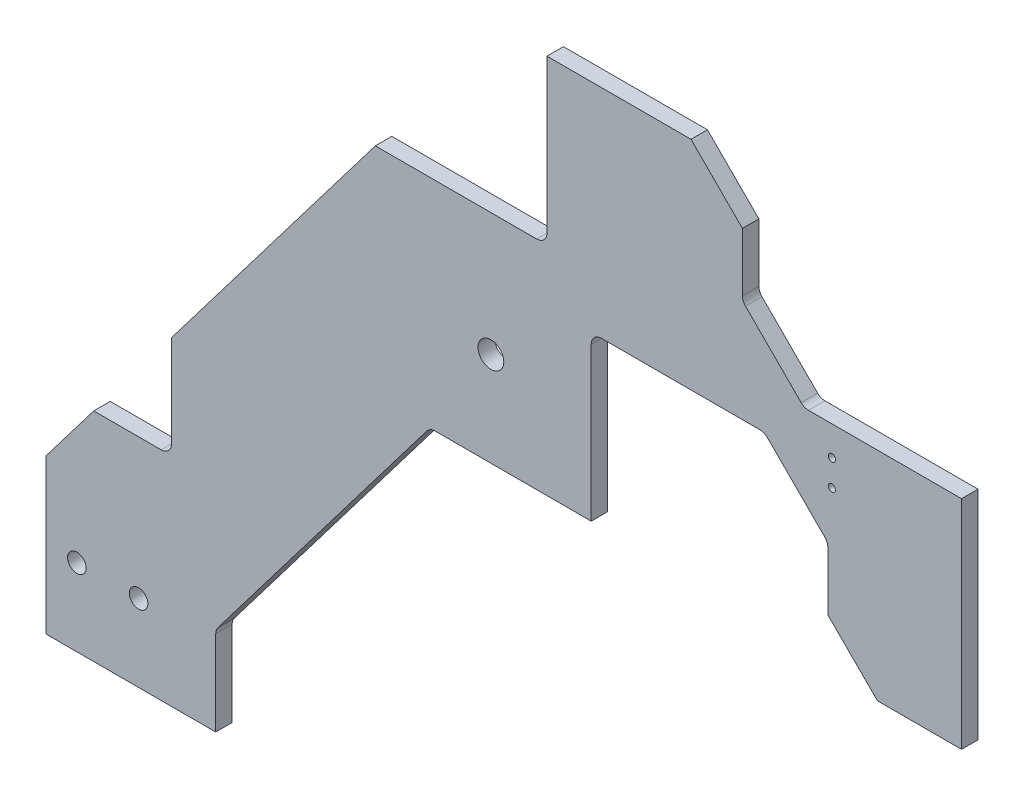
ISO-10303-21;
HEADER;
FILE_DESCRIPTION(('STEP AP214'),'2;1');
FILE_NAME('part.step','',(''),(''),'','','');
FILE_SCHEMA(('AUTOMOTIVE_DESIGN { 1 0 10303 214 1 1 1 1 }'));
ENDSEC;
DATA;
#1=APPLICATION_CONTEXT('core data for automotive mechanical design processes');
#2=APPLICATION_PROTOCOL_DEFINITION('international standard','automotive_design',2000,#1);
#3=PRODUCT_CONTEXT('',#1,'mechanical');
#4=PRODUCT('Part','Part','',(#3));
#5=PRODUCT_RELATED_PRODUCT_CATEGORY('part','',(#4));
#6=PRODUCT_DEFINITION_FORMATION('','',#4);
#7=PRODUCT_DEFINITION_CONTEXT('part definition',#1,'design');
#8=PRODUCT_DEFINITION('design','',#6,#7);
#9=PRODUCT_DEFINITION_SHAPE('','',#8);
#10=(LENGTH_UNIT() NAMED_UNIT(*) SI_UNIT(.MILLI.,.METRE.));
#11=(NAMED_UNIT(*) PLANE_ANGLE_UNIT() SI_UNIT($,.RADIAN.));
#12=(NAMED_UNIT(*) SI_UNIT($,.STERADIAN.) SOLID_ANGLE_UNIT());
#13=UNCERTAINTY_MEASURE_WITH_UNIT(LENGTH_MEASURE(1.E-05),#10,'distance_accuracy_value','');
#14=(GEOMETRIC_REPRESENTATION_CONTEXT(3) GLOBAL_UNCERTAINTY_ASSIGNED_CONTEXT((#13)) GLOBAL_UNIT_ASSIGNED_CONTEXT((#10,
#11,#12)) REPRESENTATION_CONTEXT('',''));
#15=CARTESIAN_POINT('',(0.,0.,0.));
#16=DIRECTION('',(0.,0.,1.));
#17=DIRECTION('',(1.,0.,0.));
#18=AXIS2_PLACEMENT_3D('',#15,#16,#17);
#19=CARTESIAN_POINT('',(68.7,59.308756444,0.));
#20=DIRECTION('',(0.,0.,-1.));
#21=DIRECTION('',(-1.,0.,0.));
#22=AXIS2_PLACEMENT_3D('',#19,#20,#21);
#23=CYLINDRICAL_SURFACE('',#22,1.);
#24=CARTESIAN_POINT('',(68.7,59.308756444,0.));
#25=DIRECTION('',(0.,0.,-1.));
#26=DIRECTION('',(-1.,0.,0.));
#27=AXIS2_PLACEMENT_3D('',#24,#25,#26);
#28=CIRCLE('',#27,1.);
#29=CARTESIAN_POINT('',(67.6999999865,59.308756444,0.));
#30=VERTEX_POINT('',#29);
#31=CARTESIAN_POINT('',(67.992893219,58.601649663,0.));
#32=VERTEX_POINT('',#31);
#33=EDGE_CURVE('E233',#30,#32,#28,.F.);
#34=ORIENTED_EDGE('',*,*,#33,.T.);
#35=DIRECTION('',(0.,0.,1.));
#36=VECTOR('',#35,1.);
#37=CARTESIAN_POINT('',(67.992893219,58.601649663,-0.8));
#38=LINE('',#37,#36);
#39=CARTESIAN_POINT('',(67.9928932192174,58.6016496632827,-1.6));
#40=VERTEX_POINT('',#39);
#41=EDGE_CURVE('E231',#40,#32,#38,.T.);
#42=ORIENTED_EDGE('',*,*,#41,.F.);
#43=CARTESIAN_POINT('',(68.7,59.308756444,-1.6));
#44=DIRECTION('',(0.,0.,-1.));
#45=DIRECTION('',(-1.,0.,0.));
#46=AXIS2_PLACEMENT_3D('',#43,#44,#45);
#47=CIRCLE('',#46,1.);
#48=CARTESIAN_POINT('',(67.6999999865,59.308756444,-1.6));
#49=VERTEX_POINT('',#48);
#50=EDGE_CURVE('E20',#40,#49,#47,.T.);
#51=ORIENTED_EDGE('',*,*,#50,.T.);
#52=DIRECTION('',(0.,0.,-1.));
#53=VECTOR('',#52,1.);
#54=CARTESIAN_POINT('',(67.7,59.308756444,-0.8));
#55=LINE('',#54,#53);
#56=EDGE_CURVE('E228',#30,#49,#55,.T.);
#57=ORIENTED_EDGE('',*,*,#56,.F.);
#58=EDGE_LOOP('',(#34,#42,#51,#57));
#59=FACE_BOUND('',#58,.T.);
#60=ADVANCED_FACE('F16',(#59),#23,.F.);
#61=CARTESIAN_POINT('',(74.114213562,53.894542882,0.));
#62=DIRECTION('',(0.,0.,-1.));
#63=DIRECTION('',(-1.,0.,0.));
#64=AXIS2_PLACEMENT_3D('',#61,#62,#63);
#65=CYLINDRICAL_SURFACE('',#64,1.);
#66=CARTESIAN_POINT('',(74.114213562,53.894542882,0.));
#67=DIRECTION('',(0.,0.,-1.));
#68=DIRECTION('',(-1.,0.,0.));
#69=AXIS2_PLACEMENT_3D('',#66,#67,#68);
#70=CIRCLE('',#69,1.);
#71=CARTESIAN_POINT('',(73.407106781,53.187436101,0.));
#72=VERTEX_POINT('',#71);
#73=CARTESIAN_POINT('',(74.114213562,52.894542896,0.));
#74=VERTEX_POINT('',#73);
#75=EDGE_CURVE('E489',#72,#74,#70,.F.);
#76=ORIENTED_EDGE('',*,*,#75,.T.);
#77=DIRECTION('',(0.,0.,1.));
#78=VECTOR('',#77,1.);
#79=CARTESIAN_POINT('',(74.114213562,52.894542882,-0.8));
#80=LINE('',#79,#78);
#81=CARTESIAN_POINT('',(74.114213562,52.894542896,-1.6));
#82=VERTEX_POINT('',#81);
#83=EDGE_CURVE('E357',#82,#74,#80,.T.);
#84=ORIENTED_EDGE('',*,*,#83,.F.);
#85=CARTESIAN_POINT('',(74.114213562,53.894542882,-1.6));
#86=DIRECTION('',(0.,0.,-1.));
#87=DIRECTION('',(-1.,0.,0.));
#88=AXIS2_PLACEMENT_3D('',#85,#86,#87);
#89=CIRCLE('',#88,1.);
#90=CARTESIAN_POINT('',(73.4071067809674,53.1874361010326,-1.6));
#91=VERTEX_POINT('',#90);
#92=EDGE_CURVE('E491',#82,#91,#89,.T.);
#93=ORIENTED_EDGE('',*,*,#92,.T.);
#94=DIRECTION('',(0.,0.,-1.));
#95=VECTOR('',#94,1.);
#96=CARTESIAN_POINT('',(73.407106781,53.187436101,-0.8));
#97=LINE('',#96,#95);
#98=EDGE_CURVE('E363',#72,#91,#97,.T.);
#99=ORIENTED_EDGE('',*,*,#98,.F.);
#100=EDGE_LOOP('',(#76,#84,#93,#99));
#101=FACE_BOUND('',#100,.T.);
#102=ADVANCED_FACE('F504',(#101),#65,.F.);
#103=CARTESIAN_POINT('',(75.,42.308756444,0.));
#104=DIRECTION('',(0.,0.,-1.));
#105=DIRECTION('',(-1.,0.,0.));
#106=AXIS2_PLACEMENT_3D('',#103,#104,#105);
#107=CYLINDRICAL_SURFACE('',#106,1.);
#108=CARTESIAN_POINT('',(75.,42.308756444,0.));
#109=DIRECTION('',(0.,0.,-1.));
#110=DIRECTION('',(-1.,0.,0.));
#111=AXIS2_PLACEMENT_3D('',#108,#109,#110);
#112=CIRCLE('',#111,1.);
#113=CARTESIAN_POINT('',(75.999999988,42.308756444,0.));
#114=VERTEX_POINT('',#113);
#115=CARTESIAN_POINT('',(75.7071067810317,43.0158632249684,0.));
#116=VERTEX_POINT('',#115);
#117=EDGE_CURVE('E485',#114,#116,#112,.F.);
#118=ORIENTED_EDGE('',*,*,#117,.T.);
#119=DIRECTION('',(0.,0.,1.));
#120=VECTOR('',#119,1.);
#121=CARTESIAN_POINT('',(75.707106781,43.015863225,-0.8));
#122=LINE('',#121,#120);
#123=CARTESIAN_POINT('',(75.7071067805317,43.0158632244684,-1.6));
#124=VERTEX_POINT('',#123);
#125=EDGE_CURVE('E327',#124,#116,#122,.T.);
#126=ORIENTED_EDGE('',*,*,#125,.F.);
#127=CARTESIAN_POINT('',(75.,42.308756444,-1.6));
#128=DIRECTION('',(0.,0.,-1.));
#129=DIRECTION('',(-1.,0.,0.));
#130=AXIS2_PLACEMENT_3D('',#127,#128,#129);
#131=CIRCLE('',#130,1.);
#132=CARTESIAN_POINT('',(75.999999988,42.308756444,-1.6));
#133=VERTEX_POINT('',#132);
#134=EDGE_CURVE('E487',#124,#133,#131,.T.);
#135=ORIENTED_EDGE('',*,*,#134,.T.);
#136=DIRECTION('',(0.,0.,-1.));
#137=VECTOR('',#136,1.);
#138=CARTESIAN_POINT('',(76.,42.308756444,-0.8));
#139=LINE('',#138,#137);
#140=EDGE_CURVE('E333',#114,#133,#139,.T.);
#141=ORIENTED_EDGE('',*,*,#140,.F.);
#142=EDGE_LOOP('',(#118,#126,#135,#141));
#143=FACE_BOUND('',#142,.T.);
#144=ADVANCED_FACE('F655',(#143),#107,.F.);
#145=CARTESIAN_POINT('',(69.414213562,47.894542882,0.));
#146=DIRECTION('',(0.,0.,-1.));
#147=DIRECTION('',(-1.,0.,0.));
#148=AXIS2_PLACEMENT_3D('',#145,#146,#147);
#149=CYLINDRICAL_SURFACE('',#148,1.);
#150=CARTESIAN_POINT('',(69.414213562,47.894542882,0.));
#151=DIRECTION('',(0.,0.,-1.));
#152=DIRECTION('',(-1.,0.,0.));
#153=AXIS2_PLACEMENT_3D('',#150,#151,#152);
#154=CIRCLE('',#153,1.);
#155=CARTESIAN_POINT('',(70.1213203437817,48.6016496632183,0.));
#156=VERTEX_POINT('',#155);
#157=CARTESIAN_POINT('',(69.414213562,48.8945428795,0.));
#158=VERTEX_POINT('',#157);
#159=EDGE_CURVE('E481',#156,#158,#154,.F.);
#160=ORIENTED_EDGE('',*,*,#159,.T.);
#161=DIRECTION('',(0.,0.,1.));
#162=VECTOR('',#161,1.);
#163=CARTESIAN_POINT('',(69.414213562,48.894542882,-0.8));
#164=LINE('',#163,#162);
#165=CARTESIAN_POINT('',(69.414213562,48.8945428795,-1.6));
#166=VERTEX_POINT('',#165);
#167=EDGE_CURVE('E323',#166,#158,#164,.T.);
#168=ORIENTED_EDGE('',*,*,#167,.F.);
#169=CARTESIAN_POINT('',(69.414213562,47.894542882,-1.6));
#170=DIRECTION('',(0.,0.,-1.));
#171=DIRECTION('',(-1.,0.,0.));
#172=AXIS2_PLACEMENT_3D('',#169,#170,#171);
#173=CIRCLE('',#172,1.);
#174=CARTESIAN_POINT('',(70.1213203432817,48.6016496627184,-1.6));
#175=VERTEX_POINT('',#174);
#176=EDGE_CURVE('E483',#166,#175,#173,.T.);
#177=ORIENTED_EDGE('',*,*,#176,.T.);
#178=DIRECTION('',(0.,0.,-1.));
#179=VECTOR('',#178,1.);
#180=CARTESIAN_POINT('',(70.121320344,48.601649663,-0.8));
#181=LINE('',#180,#179);
#182=EDGE_CURVE('E326',#156,#175,#181,.T.);
#183=ORIENTED_EDGE('',*,*,#182,.F.);
#184=EDGE_LOOP('',(#160,#168,#177,#183));
#185=FACE_BOUND('',#184,.T.);
#186=ADVANCED_FACE('F649',(#185),#149,.F.);
#187=CARTESIAN_POINT('',(17.5,5.276294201,0.));
#188=DIRECTION('',(0.,0.,-1.));
#189=DIRECTION('',(-1.,0.,0.));
#190=AXIS2_PLACEMENT_3D('',#187,#188,#189);
#191=CYLINDRICAL_SURFACE('',#190,1.);
#192=CARTESIAN_POINT('',(17.5,5.276294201,0.));
#193=DIRECTION('',(0.,0.,-1.));
#194=DIRECTION('',(-1.,0.,0.));
#195=AXIS2_PLACEMENT_3D('',#192,#193,#194);
#196=CIRCLE('',#195,1.);
#197=CARTESIAN_POINT('',(16.7039811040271,5.88156597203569,0.));
#198=VERTEX_POINT('',#197);
#199=CARTESIAN_POINT('',(16.499999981,5.276294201,0.));
#200=VERTEX_POINT('',#199);
#201=EDGE_CURVE('E241',#198,#200,#196,.F.);
#202=ORIENTED_EDGE('',*,*,#201,.T.);
#203=DIRECTION('',(0.,0.,1.));
#204=VECTOR('',#203,1.);
#205=CARTESIAN_POINT('',(16.5,5.276294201,-0.8));
#206=LINE('',#205,#204);
#207=CARTESIAN_POINT('',(16.499999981,5.276294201,-1.6));
#208=VERTEX_POINT('',#207);
#209=EDGE_CURVE('E303',#208,#200,#206,.T.);
#210=ORIENTED_EDGE('',*,*,#209,.F.);
#211=CARTESIAN_POINT('',(17.5,5.276294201,-1.6));
#212=DIRECTION('',(0.,0.,-1.));
#213=DIRECTION('',(-1.,0.,0.));
#214=AXIS2_PLACEMENT_3D('',#211,#212,#213);
#215=CIRCLE('',#214,1.);
#216=CARTESIAN_POINT('',(16.7039811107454,5.88156596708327,-1.6));
#217=VERTEX_POINT('',#216);
#218=EDGE_CURVE('E479',#208,#217,#215,.T.);
#219=ORIENTED_EDGE('',*,*,#218,.T.);
#220=DIRECTION('',(0.,0.,-1.));
#221=VECTOR('',#220,1.);
#222=CARTESIAN_POINT('',(16.703981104,5.881565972,-0.8));
#223=LINE('',#222,#221);
#224=EDGE_CURVE('E310',#198,#217,#223,.T.);
#225=ORIENTED_EDGE('',*,*,#224,.F.);
#226=EDGE_LOOP('',(#202,#210,#219,#225));
#227=FACE_BOUND('',#226,.T.);
#228=ADVANCED_FACE('F617',(#227),#191,.F.);
#229=CARTESIAN_POINT('',(76.4,50.04,-1.6));
#230=DIRECTION('',(0.,0.,1.));
#231=DIRECTION('',(1.,0.,0.));
#232=AXIS2_PLACEMENT_3D('',#229,#230,#231);
#233=CYLINDRICAL_SURFACE('',#232,0.349999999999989);
#234=CARTESIAN_POINT('',(76.4,50.04,0.));
#235=DIRECTION('',(0.,0.,1.));
#236=DIRECTION('',(1.,0.,0.));
#237=AXIS2_PLACEMENT_3D('',#234,#235,#236);
#238=CIRCLE('',#237,0.349999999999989);
#239=CARTESIAN_POINT('',(76.75,50.04,0.));
#240=VERTEX_POINT('',#239);
#241=EDGE_CURVE('E369',#240,#240,#238,.T.);
#242=ORIENTED_EDGE('',*,*,#241,.T.);
#243=EDGE_LOOP('',(#242));
#244=FACE_BOUND('',#243,.T.);
#245=CARTESIAN_POINT('',(76.4,50.04,-1.6));
#246=DIRECTION('',(0.,0.,1.));
#247=DIRECTION('',(1.,0.,0.));
#248=AXIS2_PLACEMENT_3D('',#245,#246,#247);
#249=CIRCLE('',#248,0.349999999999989);
#250=CARTESIAN_POINT('',(76.75,50.04,-1.6));
#251=VERTEX_POINT('',#250);
#252=EDGE_CURVE('E439',#251,#251,#249,.T.);
#253=ORIENTED_EDGE('',*,*,#252,.F.);
#254=EDGE_LOOP('',(#253));
#255=FACE_BOUND('',#254,.T.);
#256=ADVANCED_FACE('F714',(#244,#255),#233,.F.);
#257=CARTESIAN_POINT('',(76.4,47.5,-1.6));
#258=DIRECTION('',(0.,0.,1.));
#259=DIRECTION('',(1.,0.,0.));
#260=AXIS2_PLACEMENT_3D('',#257,#258,#259);
#261=CYLINDRICAL_SURFACE('',#260,0.349999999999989);
#262=CARTESIAN_POINT('',(76.4,47.5,0.));
#263=DIRECTION('',(0.,0.,1.));
#264=DIRECTION('',(1.,0.,0.));
#265=AXIS2_PLACEMENT_3D('',#262,#263,#264);
#266=CIRCLE('',#265,0.349999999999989);
#267=CARTESIAN_POINT('',(76.75,47.5,0.));
#268=VERTEX_POINT('',#267);
#269=EDGE_CURVE('E269',#268,#268,#266,.T.);
#270=ORIENTED_EDGE('',*,*,#269,.T.);
#271=EDGE_LOOP('',(#270));
#272=FACE_BOUND('',#271,.T.);
#273=CARTESIAN_POINT('',(76.4,47.5,-1.6));
#274=DIRECTION('',(0.,0.,1.));
#275=DIRECTION('',(1.,0.,0.));
#276=AXIS2_PLACEMENT_3D('',#273,#274,#275);
#277=CIRCLE('',#276,0.349999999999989);
#278=CARTESIAN_POINT('',(76.75,47.5,-1.6));
#279=VERTEX_POINT('',#278);
#280=EDGE_CURVE('E436',#279,#279,#277,.T.);
#281=ORIENTED_EDGE('',*,*,#280,.F.);
#282=EDGE_LOOP('',(#281));
#283=FACE_BOUND('',#282,.T.);
#284=ADVANCED_FACE('F710',(#272,#283),#261,.F.);
#285=CARTESIAN_POINT('',(67.7,65.,-1.6));
#286=DIRECTION('',(0.707106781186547,0.707106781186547,0.));
#287=DIRECTION('',(-0.707106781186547,0.707106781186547,0.));
#288=AXIS2_PLACEMENT_3D('',#285,#286,#287);
#289=PLANE('',#288);
#290=DIRECTION('',(0.707106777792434,-0.70710678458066,0.));
#291=VECTOR('',#290,1.);
#292=CARTESIAN_POINT('',(62.699999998,70.,-1.6));
#293=LINE('',#292,#291);
#294=CARTESIAN_POINT('',(62.699999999,70.,-1.6));
#295=VERTEX_POINT('',#294);
#296=CARTESIAN_POINT('',(67.69999997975,64.9999999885,-1.6));
#297=VERTEX_POINT('',#296);
#298=EDGE_CURVE('E246',#295,#297,#293,.T.);
#299=ORIENTED_EDGE('',*,*,#298,.F.);
#300=DIRECTION('',(0.,0.,-1.));
#301=VECTOR('',#300,1.);
#302=CARTESIAN_POINT('',(62.7,70.,-0.8));
#303=LINE('',#302,#301);
#304=CARTESIAN_POINT('',(62.7,70.,0.));
#305=VERTEX_POINT('',#304);
#306=EDGE_CURVE('E260',#305,#295,#303,.T.);
#307=ORIENTED_EDGE('',*,*,#306,.F.);
#308=DIRECTION('',(-0.707106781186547,0.707106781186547,0.));
#309=VECTOR('',#308,1.);
#310=CARTESIAN_POINT('',(67.7,65.,0.));
#311=LINE('',#310,#309);
#312=CARTESIAN_POINT('',(67.6999999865,65.0000000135,0.));
#313=VERTEX_POINT('',#312);
#314=EDGE_CURVE('E433',#305,#313,#311,.F.);
#315=ORIENTED_EDGE('',*,*,#314,.T.);
#316=DIRECTION('',(0.,0.,1.));
#317=VECTOR('',#316,1.);
#318=CARTESIAN_POINT('',(67.7,65.,-0.8));
#319=LINE('',#318,#317);
#320=EDGE_CURVE('E240',#297,#313,#319,.T.);
#321=ORIENTED_EDGE('',*,*,#320,.F.);
#322=EDGE_LOOP('',(#299,#307,#315,#321));
#323=FACE_BOUND('',#322,.T.);
#324=ADVANCED_FACE('F713',(#323),#289,.T.);
#325=CARTESIAN_POINT('',(67.7,59.308756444,0.));
#326=DIRECTION('',(1.,0.,0.));
#327=DIRECTION('',(0.,0.,-1.));
#328=AXIS2_PLACEMENT_3D('',#325,#326,#327);
#329=PLANE('',#328);
#330=DIRECTION('',(0.,-1.,0.));
#331=VECTOR('',#330,1.);
#332=CARTESIAN_POINT('',(67.699999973,33.5,-1.6));
#333=LINE('',#332,#331);
#334=EDGE_CURVE('E237',#297,#49,#333,.T.);
#335=ORIENTED_EDGE('',*,*,#334,.F.);
#336=ORIENTED_EDGE('',*,*,#320,.T.);
#337=DIRECTION('',(0.,-1.,0.));
#338=VECTOR('',#337,1.);
#339=CARTESIAN_POINT('',(67.699999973,33.5,0.));
#340=LINE('',#339,#338);
#341=EDGE_CURVE('E239',#313,#30,#340,.T.);
#342=ORIENTED_EDGE('',*,*,#341,.T.);
#343=ORIENTED_EDGE('',*,*,#56,.T.);
#344=EDGE_LOOP('',(#335,#336,#342,#343));
#345=FACE_BOUND('',#344,.T.);
#346=ADVANCED_FACE('F236',(#345),#329,.T.);
#347=CARTESIAN_POINT('',(73.407106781,53.187436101,-1.6));
#348=DIRECTION('',(0.707106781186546,0.707106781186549,0.));
#349=DIRECTION('',(-0.707106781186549,0.707106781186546,0.));
#350=AXIS2_PLACEMENT_3D('',#347,#348,#349);
#351=PLANE('',#350);
#352=DIRECTION('',(0.707106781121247,-0.707106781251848,0.));
#353=VECTOR('',#352,1.);
#354=CARTESIAN_POINT('',(67.992893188,58.601649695,-1.6));
#355=LINE('',#354,#353);
#356=EDGE_CURVE('E248',#40,#91,#355,.T.);
#357=ORIENTED_EDGE('',*,*,#356,.F.);
#358=ORIENTED_EDGE('',*,*,#41,.T.);
#359=DIRECTION('',(-0.707106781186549,0.707106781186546,0.));
#360=VECTOR('',#359,1.);
#361=CARTESIAN_POINT('',(73.407106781,53.187436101,0.));
#362=LINE('',#361,#360);
#363=EDGE_CURVE('E430',#32,#72,#362,.F.);
#364=ORIENTED_EDGE('',*,*,#363,.T.);
#365=ORIENTED_EDGE('',*,*,#98,.T.);
#366=EDGE_LOOP('',(#357,#358,#364,#365));
#367=FACE_BOUND('',#366,.T.);
#368=ADVANCED_FACE('F495',(#367),#351,.T.);
#369=CARTESIAN_POINT('',(74.114213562,52.894542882,-1.6));
#370=DIRECTION('',(0.,1.,0.));
#371=DIRECTION('',(0.,0.,1.));
#372=AXIS2_PLACEMENT_3D('',#369,#370,#371);
#373=PLANE('',#372);
#374=DIRECTION('',(1.,0.,0.));
#375=VECTOR('',#374,1.);
#376=CARTESIAN_POINT('',(44.5,52.89454291,0.));
#377=LINE('',#376,#375);
#378=CARTESIAN_POINT('',(89.,52.8945429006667,0.));
#379=VERTEX_POINT('',#378);
#380=EDGE_CURVE('E353',#74,#379,#377,.T.);
#381=ORIENTED_EDGE('',*,*,#380,.T.);
#382=DIRECTION('',(0.,0.,1.));
#383=VECTOR('',#382,1.);
#384=CARTESIAN_POINT('',(89.,52.894542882,-0.8));
#385=LINE('',#384,#383);
#386=CARTESIAN_POINT('',(89.,52.8945429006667,-1.6));
#387=VERTEX_POINT('',#386);
#388=EDGE_CURVE('E348',#387,#379,#385,.T.);
#389=ORIENTED_EDGE('',*,*,#388,.F.);
#390=DIRECTION('',(1.,0.,0.));
#391=VECTOR('',#390,1.);
#392=CARTESIAN_POINT('',(44.5,52.89454291,-1.6));
#393=LINE('',#392,#391);
#394=EDGE_CURVE('E250',#82,#387,#393,.T.);
#395=ORIENTED_EDGE('',*,*,#394,.F.);
#396=ORIENTED_EDGE('',*,*,#83,.T.);
#397=EDGE_LOOP('',(#381,#389,#395,#396));
#398=FACE_BOUND('',#397,.T.);
#399=ADVANCED_FACE('F508',(#398),#373,.T.);
#400=CARTESIAN_POINT('',(89.,31.789085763,0.));
#401=DIRECTION('',(1.,0.,0.));
#402=DIRECTION('',(0.,0.,-1.));
#403=AXIS2_PLACEMENT_3D('',#400,#401,#402);
#404=PLANE('',#403);
#405=DIRECTION('',(0.,-1.,0.));
#406=VECTOR('',#405,1.);
#407=CARTESIAN_POINT('',(89.,33.5,-1.6));
#408=LINE('',#407,#406);
#409=CARTESIAN_POINT('',(89.,31.789085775,-1.6));
#410=VERTEX_POINT('',#409);
#411=EDGE_CURVE('E385',#387,#410,#408,.T.);
#412=ORIENTED_EDGE('',*,*,#411,.F.);
#413=ORIENTED_EDGE('',*,*,#388,.T.);
#414=DIRECTION('',(0.,-1.,0.));
#415=VECTOR('',#414,1.);
#416=CARTESIAN_POINT('',(89.,33.5,0.));
#417=LINE('',#416,#415);
#418=CARTESIAN_POINT('',(89.,31.789085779,0.));
#419=VERTEX_POINT('',#418);
#420=EDGE_CURVE('E344',#379,#419,#417,.T.);
#421=ORIENTED_EDGE('',*,*,#420,.T.);
#422=DIRECTION('',(0.,0.,1.));
#423=VECTOR('',#422,1.);
#424=CARTESIAN_POINT('',(89.,31.789085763,-0.8));
#425=LINE('',#424,#423);
#426=EDGE_CURVE('E339',#410,#419,#425,.T.);
#427=ORIENTED_EDGE('',*,*,#426,.F.);
#428=EDGE_LOOP('',(#412,#413,#421,#427));
#429=FACE_BOUND('',#428,.T.);
#430=ADVANCED_FACE('F672',(#429),#404,.T.);
#431=CARTESIAN_POINT('',(80.828427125,31.789085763,-1.6));
#432=DIRECTION('',(0.,-1.,0.));
#433=DIRECTION('',(1.,0.,0.));
#434=AXIS2_PLACEMENT_3D('',#431,#432,#433);
#435=PLANE('',#434);
#436=DIRECTION('',(-1.,0.,0.));
#437=VECTOR('',#436,1.);
#438=CARTESIAN_POINT('',(44.5,31.789085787,-1.6));
#439=LINE('',#438,#437);
#440=CARTESIAN_POINT('',(80.828427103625,31.789085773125,-1.6));
#441=VERTEX_POINT('',#440);
#442=EDGE_CURVE('E382',#410,#441,#439,.T.);
#443=ORIENTED_EDGE('',*,*,#442,.F.);
#444=ORIENTED_EDGE('',*,*,#426,.T.);
#445=DIRECTION('',(-1.,0.,0.));
#446=VECTOR('',#445,1.);
#447=CARTESIAN_POINT('',(44.5,31.789085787,0.));
#448=LINE('',#447,#446);
#449=CARTESIAN_POINT('',(80.828427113,31.789085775,0.));
#450=VERTEX_POINT('',#449);
#451=EDGE_CURVE('E340',#419,#450,#448,.T.);
#452=ORIENTED_EDGE('',*,*,#451,.T.);
#453=DIRECTION('',(0.,0.,1.));
#454=VECTOR('',#453,1.);
#455=CARTESIAN_POINT('',(80.828427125,31.789085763,-0.8));
#456=LINE('',#455,#454);
#457=EDGE_CURVE('E336',#441,#450,#456,.T.);
#458=ORIENTED_EDGE('',*,*,#457,.F.);
#459=EDGE_LOOP('',(#443,#444,#452,#458));
#460=FACE_BOUND('',#459,.T.);
#461=ADVANCED_FACE('F669',(#460),#435,.T.);
#462=CARTESIAN_POINT('',(76.,36.617512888,-1.6));
#463=DIRECTION('',(-0.707106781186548,-0.707106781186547,0.));
#464=DIRECTION('',(0.707106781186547,-0.707106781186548,0.));
#465=AXIS2_PLACEMENT_3D('',#462,#463,#464);
#466=PLANE('',#465);
#467=DIRECTION('',(-0.707106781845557,0.707106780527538,0.));
#468=VECTOR('',#467,1.);
#469=CARTESIAN_POINT('',(80.828427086,31.789085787,-1.6));
#470=LINE('',#469,#468);
#471=CARTESIAN_POINT('',(75.999999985,36.617512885,-1.6));
#472=VERTEX_POINT('',#471);
#473=EDGE_CURVE('E384',#441,#472,#470,.T.);
#474=ORIENTED_EDGE('',*,*,#473,.F.);
#475=ORIENTED_EDGE('',*,*,#457,.T.);
#476=DIRECTION('',(0.707106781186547,-0.707106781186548,0.));
#477=VECTOR('',#476,1.);
#478=CARTESIAN_POINT('',(76.,36.617512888,0.));
#479=LINE('',#478,#477);
#480=CARTESIAN_POINT('',(75.999999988,36.6175129,0.));
#481=VERTEX_POINT('',#480);
#482=EDGE_CURVE('E343',#450,#481,#479,.F.);
#483=ORIENTED_EDGE('',*,*,#482,.T.);
#484=DIRECTION('',(0.,0.,1.));
#485=VECTOR('',#484,1.);
#486=CARTESIAN_POINT('',(76.,36.617512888,-0.8));
#487=LINE('',#486,#485);
#488=EDGE_CURVE('E330',#472,#481,#487,.T.);
#489=ORIENTED_EDGE('',*,*,#488,.F.);
#490=EDGE_LOOP('',(#474,#475,#483,#489));
#491=FACE_BOUND('',#490,.T.);
#492=ADVANCED_FACE('F664',(#491),#466,.T.);
#493=CARTESIAN_POINT('',(76.,36.617512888,-1.6));
#494=DIRECTION('',(-1.,0.,0.));
#495=DIRECTION('',(0.,0.,1.));
#496=AXIS2_PLACEMENT_3D('',#493,#494,#495);
#497=PLANE('',#496);
#498=DIRECTION('',(0.,1.,0.));
#499=VECTOR('',#498,1.);
#500=CARTESIAN_POINT('',(75.999999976,33.5,-1.6));
#501=LINE('',#500,#499);
#502=EDGE_CURVE('E472',#472,#133,#501,.T.);
#503=ORIENTED_EDGE('',*,*,#502,.F.);
#504=ORIENTED_EDGE('',*,*,#488,.T.);
#505=DIRECTION('',(0.,1.,0.));
#506=VECTOR('',#505,1.);
#507=CARTESIAN_POINT('',(75.999999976,33.5,0.));
#508=LINE('',#507,#506);
#509=EDGE_CURVE('E427',#481,#114,#508,.T.);
#510=ORIENTED_EDGE('',*,*,#509,.T.);
#511=ORIENTED_EDGE('',*,*,#140,.T.);
#512=EDGE_LOOP('',(#503,#504,#510,#511));
#513=FACE_BOUND('',#512,.T.);
#514=ADVANCED_FACE('F673',(#513),#497,.T.);
#515=CARTESIAN_POINT('',(70.121320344,48.601649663,-1.6));
#516=DIRECTION('',(-0.70710678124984,-0.707106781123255,0.));
#517=DIRECTION('',(0.707106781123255,-0.70710678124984,0.));
#518=AXIS2_PLACEMENT_3D('',#515,#516,#517);
#519=PLANE('',#518);
#520=DIRECTION('',(0.707106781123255,-0.70710678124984,0.));
#521=VECTOR('',#520,1.);
#522=CARTESIAN_POINT('',(70.121320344,48.601649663,0.));
#523=LINE('',#522,#521);
#524=EDGE_CURVE('E424',#116,#156,#523,.F.);
#525=ORIENTED_EDGE('',*,*,#524,.T.);
#526=ORIENTED_EDGE('',*,*,#182,.T.);
#527=DIRECTION('',(-0.707106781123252,0.707106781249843,0.));
#528=VECTOR('',#527,1.);
#529=CARTESIAN_POINT('',(75.707106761,43.015863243,-1.6));
#530=LINE('',#529,#528);
#531=EDGE_CURVE('E469',#124,#175,#530,.T.);
#532=ORIENTED_EDGE('',*,*,#531,.F.);
#533=ORIENTED_EDGE('',*,*,#125,.T.);
#534=EDGE_LOOP('',(#525,#526,#532,#533));
#535=FACE_BOUND('',#534,.T.);
#536=ADVANCED_FACE('F652',(#535),#519,.T.);
#537=CARTESIAN_POINT('',(54.,48.894542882,0.));
#538=DIRECTION('',(0.,-1.,0.));
#539=DIRECTION('',(0.,0.,-1.));
#540=AXIS2_PLACEMENT_3D('',#537,#538,#539);
#541=PLANE('',#540);
#542=DIRECTION('',(-1.,0.,0.));
#543=VECTOR('',#542,1.);
#544=CARTESIAN_POINT('',(44.5,48.894542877,0.));
#545=LINE('',#544,#543);
#546=CARTESIAN_POINT('',(54.0000000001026,48.8945428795,0.));
#547=VERTEX_POINT('',#546);
#548=EDGE_CURVE('E423',#158,#547,#545,.T.);
#549=ORIENTED_EDGE('',*,*,#548,.T.);
#550=DIRECTION('',(0.,0.,-1.));
#551=VECTOR('',#550,1.);
#552=CARTESIAN_POINT('',(54.0000000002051,48.894542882,-0.8));
#553=LINE('',#552,#551);
#554=CARTESIAN_POINT('',(54.0000000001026,48.8945428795,-1.6));
#555=VERTEX_POINT('',#554);
#556=EDGE_CURVE('E321',#555,#547,#553,.F.);
#557=ORIENTED_EDGE('',*,*,#556,.F.);
#558=DIRECTION('',(-1.,0.,0.));
#559=VECTOR('',#558,1.);
#560=CARTESIAN_POINT('',(44.5,48.894542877,-1.6));
#561=LINE('',#560,#559);
#562=EDGE_CURVE('E468',#166,#555,#561,.T.);
#563=ORIENTED_EDGE('',*,*,#562,.F.);
#564=ORIENTED_EDGE('',*,*,#167,.T.);
#565=EDGE_LOOP('',(#549,#557,#563,#564));
#566=FACE_BOUND('',#565,.T.);
#567=ADVANCED_FACE('F644',(#566),#541,.T.);
#568=CARTESIAN_POINT('',(54.,47.894542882,0.));
#569=DIRECTION('',(0.,0.,-1.));
#570=DIRECTION('',(-1.,0.,0.));
#571=AXIS2_PLACEMENT_3D('',#568,#569,#570);
#572=CYLINDRICAL_SURFACE('',#571,1.);
#573=CARTESIAN_POINT('',(54.,47.894542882,0.));
#574=DIRECTION('',(0.,0.,-1.));
#575=DIRECTION('',(-1.,0.,0.));
#576=AXIS2_PLACEMENT_3D('',#573,#574,#575);
#577=CIRCLE('',#576,1.);
#578=CARTESIAN_POINT('',(53.000000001,47.894542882,0.));
#579=VERTEX_POINT('',#578);
#580=EDGE_CURVE('E419',#547,#579,#577,.F.);
#581=ORIENTED_EDGE('',*,*,#580,.T.);
#582=DIRECTION('',(0.,0.,1.));
#583=VECTOR('',#582,1.);
#584=CARTESIAN_POINT('',(53.,47.894542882,-0.8));
#585=LINE('',#584,#583);
#586=CARTESIAN_POINT('',(53.000000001,47.894542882,-1.6));
#587=VERTEX_POINT('',#586);
#588=EDGE_CURVE('E317',#587,#579,#585,.T.);
#589=ORIENTED_EDGE('',*,*,#588,.F.);
#590=CARTESIAN_POINT('',(54.,47.894542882,-1.6));
#591=DIRECTION('',(0.,0.,-1.));
#592=DIRECTION('',(-1.,0.,0.));
#593=AXIS2_PLACEMENT_3D('',#590,#591,#592);
#594=CIRCLE('',#593,1.);
#595=EDGE_CURVE('E465',#555,#587,#594,.F.);
#596=ORIENTED_EDGE('',*,*,#595,.F.);
#597=ORIENTED_EDGE('',*,*,#556,.T.);
#598=EDGE_LOOP('',(#581,#589,#596,#597));
#599=FACE_BOUND('',#598,.T.);
#600=ADVANCED_FACE('F639',(#599),#572,.F.);
#601=CARTESIAN_POINT('',(53.,33.,-1.6));
#602=DIRECTION('',(1.,0.,0.));
#603=DIRECTION('',(0.,1.,0.));
#604=AXIS2_PLACEMENT_3D('',#601,#602,#603);
#605=PLANE('',#604);
#606=DIRECTION('',(0.,-1.,0.));
#607=VECTOR('',#606,1.);
#608=CARTESIAN_POINT('',(53.000000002,33.5,0.));
#609=LINE('',#608,#607);
#610=CARTESIAN_POINT('',(53.0000000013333,33.0000000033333,0.));
#611=VERTEX_POINT('',#610);
#612=EDGE_CURVE('E422',#579,#611,#609,.T.);
#613=ORIENTED_EDGE('',*,*,#612,.T.);
#614=DIRECTION('',(0.,0.,1.));
#615=VECTOR('',#614,1.);
#616=CARTESIAN_POINT('',(53.,33.,-0.8));
#617=LINE('',#616,#615);
#618=CARTESIAN_POINT('',(53.0000000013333,33.0000000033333,-1.6));
#619=VERTEX_POINT('',#618);
#620=EDGE_CURVE('E315',#619,#611,#617,.T.);
#621=ORIENTED_EDGE('',*,*,#620,.F.);
#622=DIRECTION('',(0.,-1.,0.));
#623=VECTOR('',#622,1.);
#624=CARTESIAN_POINT('',(53.000000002,33.5,-1.6));
#625=LINE('',#624,#623);
#626=EDGE_CURVE('E467',#587,#619,#625,.T.);
#627=ORIENTED_EDGE('',*,*,#626,.F.);
#628=ORIENTED_EDGE('',*,*,#588,.T.);
#629=EDGE_LOOP('',(#613,#621,#627,#628));
#630=FACE_BOUND('',#629,.T.);
#631=ADVANCED_FACE('F634',(#630),#605,.T.);
#632=CARTESIAN_POINT('',(37.820000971,33.,0.));
#633=DIRECTION('',(0.,-1.,0.));
#634=DIRECTION('',(0.,0.,-1.));
#635=AXIS2_PLACEMENT_3D('',#632,#633,#634);
#636=PLANE('',#635);
#637=DIRECTION('',(-1.,0.,0.));
#638=VECTOR('',#637,1.);
#639=CARTESIAN_POINT('',(44.5,33.000000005,-1.6));
#640=LINE('',#639,#638);
#641=CARTESIAN_POINT('',(37.8200009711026,33.0000000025,-1.6));
#642=VERTEX_POINT('',#641);
#643=EDGE_CURVE('E464',#619,#642,#640,.T.);
#644=ORIENTED_EDGE('',*,*,#643,.F.);
#645=ORIENTED_EDGE('',*,*,#620,.T.);
#646=DIRECTION('',(-1.,0.,0.));
#647=VECTOR('',#646,1.);
#648=CARTESIAN_POINT('',(44.5,33.000000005,0.));
#649=LINE('',#648,#647);
#650=CARTESIAN_POINT('',(37.8200009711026,33.0000000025,0.));
#651=VERTEX_POINT('',#650);
#652=EDGE_CURVE('E418',#611,#651,#649,.T.);
#653=ORIENTED_EDGE('',*,*,#652,.T.);
#654=DIRECTION('',(0.,0.,-1.));
#655=VECTOR('',#654,1.);
#656=CARTESIAN_POINT('',(37.8200009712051,33.,-0.8));
#657=LINE('',#656,#655);
#658=EDGE_CURVE('E313',#642,#651,#657,.F.);
#659=ORIENTED_EDGE('',*,*,#658,.F.);
#660=EDGE_LOOP('',(#644,#645,#653,#659));
#661=FACE_BOUND('',#660,.T.);
#662=ADVANCED_FACE('F630',(#661),#636,.T.);
#663=CARTESIAN_POINT('',(37.820000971,32.,0.));
#664=DIRECTION('',(0.,0.,-1.));
#665=DIRECTION('',(-1.,0.,0.));
#666=AXIS2_PLACEMENT_3D('',#663,#664,#665);
#667=CYLINDRICAL_SURFACE('',#666,1.);
#668=CARTESIAN_POINT('',(37.820000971,32.,0.));
#669=DIRECTION('',(0.,0.,-1.));
#670=DIRECTION('',(-1.,0.,0.));
#671=AXIS2_PLACEMENT_3D('',#668,#669,#670);
#672=CIRCLE('',#671,1.);
#673=CARTESIAN_POINT('',(37.0239820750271,32.6052717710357,0.));
#674=VERTEX_POINT('',#673);
#675=EDGE_CURVE('E415',#651,#674,#672,.F.);
#676=ORIENTED_EDGE('',*,*,#675,.T.);
#677=DIRECTION('',(0.,0.,1.));
#678=VECTOR('',#677,1.);
#679=CARTESIAN_POINT('',(37.023982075,32.605271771,-0.8));
#680=LINE('',#679,#678);
#681=CARTESIAN_POINT('',(37.0239820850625,32.605271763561,-1.6));
#682=VERTEX_POINT('',#681);
#683=EDGE_CURVE('E308',#682,#674,#680,.T.);
#684=ORIENTED_EDGE('',*,*,#683,.F.);
#685=CARTESIAN_POINT('',(37.820000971,32.,-1.6));
#686=DIRECTION('',(0.,0.,-1.));
#687=DIRECTION('',(-1.,0.,0.));
#688=AXIS2_PLACEMENT_3D('',#685,#686,#687);
#689=CIRCLE('',#688,1.);
#690=EDGE_CURVE('E462',#642,#682,#689,.F.);
#691=ORIENTED_EDGE('',*,*,#690,.F.);
#692=ORIENTED_EDGE('',*,*,#658,.T.);
#693=EDGE_LOOP('',(#676,#684,#691,#692));
#694=FACE_BOUND('',#693,.T.);
#695=ADVANCED_FACE('F624',(#694),#667,.F.);
#696=CARTESIAN_POINT('',(16.703981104,5.881565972,-1.6));
#697=DIRECTION('',(0.796018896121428,-0.605271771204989,0.));
#698=DIRECTION('',(0.605271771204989,0.796018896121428,0.));
#699=AXIS2_PLACEMENT_3D('',#696,#697,#698);
#700=PLANE('',#699);
#701=DIRECTION('',(-0.605271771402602,-0.796018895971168,0.));
#702=VECTOR('',#701,1.);
#703=CARTESIAN_POINT('',(37.023982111,32.605271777,-1.6));
#704=LINE('',#703,#702);
#705=EDGE_CURVE('E459',#682,#217,#704,.T.);
#706=ORIENTED_EDGE('',*,*,#705,.F.);
#707=ORIENTED_EDGE('',*,*,#683,.T.);
#708=DIRECTION('',(0.605271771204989,0.796018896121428,0.));
#709=VECTOR('',#708,1.);
#710=CARTESIAN_POINT('',(16.703981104,5.881565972,0.));
#711=LINE('',#710,#709);
#712=EDGE_CURVE('E412',#674,#198,#711,.F.);
#713=ORIENTED_EDGE('',*,*,#712,.T.);
#714=ORIENTED_EDGE('',*,*,#224,.T.);
#715=EDGE_LOOP('',(#706,#707,#713,#714));
#716=FACE_BOUND('',#715,.T.);
#717=ADVANCED_FACE('F620',(#716),#700,.T.);
#718=CARTESIAN_POINT('',(16.5,-3.,0.));
#719=DIRECTION('',(1.,0.,0.));
#720=DIRECTION('',(0.,0.,-1.));
#721=AXIS2_PLACEMENT_3D('',#718,#719,#720);
#722=PLANE('',#721);
#723=DIRECTION('',(0.,-1.,0.));
#724=VECTOR('',#723,1.);
#725=CARTESIAN_POINT('',(16.499999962,33.5,0.));
#726=LINE('',#725,#724);
#727=CARTESIAN_POINT('',(16.4999999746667,-3.,0.));
#728=VERTEX_POINT('',#727);
#729=EDGE_CURVE('E299',#200,#728,#726,.T.);
#730=ORIENTED_EDGE('',*,*,#729,.T.);
#731=DIRECTION('',(0.,0.,1.));
#732=VECTOR('',#731,1.);
#733=CARTESIAN_POINT('',(16.5,-3.,-0.8));
#734=LINE('',#733,#732);
#735=CARTESIAN_POINT('',(16.4999999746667,-3.,-1.6));
#736=VERTEX_POINT('',#735);
#737=EDGE_CURVE('E294',#736,#728,#734,.T.);
#738=ORIENTED_EDGE('',*,*,#737,.F.);
#739=DIRECTION('',(0.,-1.,0.));
#740=VECTOR('',#739,1.);
#741=CARTESIAN_POINT('',(16.499999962,33.5,-1.6));
#742=LINE('',#741,#740);
#743=EDGE_CURVE('E379',#208,#736,#742,.T.);
#744=ORIENTED_EDGE('',*,*,#743,.F.);
#745=ORIENTED_EDGE('',*,*,#209,.T.);
#746=EDGE_LOOP('',(#730,#738,#744,#745));
#747=FACE_BOUND('',#746,.T.);
#748=ADVANCED_FACE('F611',(#747),#722,.T.);
#749=CARTESIAN_POINT('',(0.,-3.,-1.6));
#750=DIRECTION('',(0.,-1.,0.));
#751=DIRECTION('',(1.,0.,0.));
#752=AXIS2_PLACEMENT_3D('',#749,#750,#751);
#753=PLANE('',#752);
#754=DIRECTION('',(-1.,0.,0.));
#755=VECTOR('',#754,1.);
#756=CARTESIAN_POINT('',(44.5,-3.,-1.6));
#757=LINE('',#756,#755);
#758=CARTESIAN_POINT('',(0.,-3.,-1.6));
#759=VERTEX_POINT('',#758);
#760=EDGE_CURVE('E375',#736,#759,#757,.T.);
#761=ORIENTED_EDGE('',*,*,#760,.F.);
#762=ORIENTED_EDGE('',*,*,#737,.T.);
#763=DIRECTION('',(-1.,0.,0.));
#764=VECTOR('',#763,1.);
#765=CARTESIAN_POINT('',(44.5,-3.,0.));
#766=LINE('',#765,#764);
#767=CARTESIAN_POINT('',(0.,-3.,0.));
#768=VERTEX_POINT('',#767);
#769=EDGE_CURVE('E290',#728,#768,#766,.T.);
#770=ORIENTED_EDGE('',*,*,#769,.T.);
#771=DIRECTION('',(0.,0.,1.));
#772=VECTOR('',#771,1.);
#773=CARTESIAN_POINT('',(0.,-3.,-0.8));
#774=LINE('',#773,#772);
#775=EDGE_CURVE('E285',#759,#768,#774,.T.);
#776=ORIENTED_EDGE('',*,*,#775,.F.);
#777=EDGE_LOOP('',(#761,#762,#770,#776));
#778=FACE_BOUND('',#777,.T.);
#779=ADVANCED_FACE('F607',(#778),#753,.T.);
#780=CARTESIAN_POINT('',(0.,12.,-1.6));
#781=DIRECTION('',(-1.,0.,0.));
#782=DIRECTION('',(0.,-1.,0.));
#783=AXIS2_PLACEMENT_3D('',#780,#781,#782);
#784=PLANE('',#783);
#785=DIRECTION('',(0.,1.,0.));
#786=VECTOR('',#785,1.);
#787=CARTESIAN_POINT('',(0.,33.5,-1.6));
#788=LINE('',#787,#786);
#789=CARTESIAN_POINT('',(0.,11.999999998,-1.6));
#790=VERTEX_POINT('',#789);
#791=EDGE_CURVE('E372',#759,#790,#788,.T.);
#792=ORIENTED_EDGE('',*,*,#791,.F.);
#793=ORIENTED_EDGE('',*,*,#775,.T.);
#794=DIRECTION('',(0.,1.,0.));
#795=VECTOR('',#794,1.);
#796=CARTESIAN_POINT('',(0.,33.5,0.));
#797=LINE('',#796,#795);
#798=CARTESIAN_POINT('',(0.,12.,0.));
#799=VERTEX_POINT('',#798);
#800=EDGE_CURVE('E286',#768,#799,#797,.T.);
#801=ORIENTED_EDGE('',*,*,#800,.T.);
#802=DIRECTION('',(0.,0.,1.));
#803=VECTOR('',#802,1.);
#804=CARTESIAN_POINT('',(0.,12.,-0.8));
#805=LINE('',#804,#803);
#806=EDGE_CURVE('E283',#790,#799,#805,.T.);
#807=ORIENTED_EDGE('',*,*,#806,.F.);
#808=EDGE_LOOP('',(#792,#793,#801,#807));
#809=FACE_BOUND('',#808,.T.);
#810=ADVANCED_FACE('F601',(#809),#784,.T.);
#811=CARTESIAN_POINT('',(4.642428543,18.105457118,-1.6));
#812=DIRECTION('',(-0.796018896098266,0.605271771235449,0.));
#813=DIRECTION('',(-0.605271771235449,-0.796018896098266,0.));
#814=AXIS2_PLACEMENT_3D('',#811,#812,#813);
#815=PLANE('',#814);
#816=DIRECTION('',(0.605271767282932,0.796018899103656,0.));
#817=VECTOR('',#816,1.);
#818=CARTESIAN_POINT('',(0.,11.999999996,-1.6));
#819=LINE('',#818,#817);
#820=CARTESIAN_POINT('',(4.64242852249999,18.10545712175,-1.6));
#821=VERTEX_POINT('',#820);
#822=EDGE_CURVE('E374',#790,#821,#819,.T.);
#823=ORIENTED_EDGE('',*,*,#822,.F.);
#824=ORIENTED_EDGE('',*,*,#806,.T.);
#825=DIRECTION('',(-0.605271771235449,-0.796018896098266,0.));
#826=VECTOR('',#825,1.);
#827=CARTESIAN_POINT('',(4.642428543,18.105457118,0.));
#828=LINE('',#827,#826);
#829=CARTESIAN_POINT('',(4.64242854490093,18.1054571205,0.));
#830=VERTEX_POINT('',#829);
#831=EDGE_CURVE('E289',#799,#830,#828,.F.);
#832=ORIENTED_EDGE('',*,*,#831,.T.);
#833=DIRECTION('',(0.,0.,1.));
#834=VECTOR('',#833,1.);
#835=CARTESIAN_POINT('',(4.642428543,18.105457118,-0.8));
#836=LINE('',#835,#834);
#837=EDGE_CURVE('E281',#821,#830,#836,.T.);
#838=ORIENTED_EDGE('',*,*,#837,.F.);
#839=EDGE_LOOP('',(#823,#824,#832,#838));
#840=FACE_BOUND('',#839,.T.);
#841=ADVANCED_FACE('F597',(#840),#815,.T.);
#842=CARTESIAN_POINT('',(4.642428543,18.105457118,-1.6));
#843=DIRECTION('',(0.,1.,0.));
#844=DIRECTION('',(0.,0.,1.));
#845=AXIS2_PLACEMENT_3D('',#842,#843,#844);
#846=PLANE('',#845);
#847=DIRECTION('',(1.,0.,0.));
#848=VECTOR('',#847,1.);
#849=CARTESIAN_POINT('',(44.5,18.105457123,-1.6));
#850=LINE('',#849,#848);
#851=CARTESIAN_POINT('',(11.2000000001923,18.1054571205,-1.6));
#852=VERTEX_POINT('',#851);
#853=EDGE_CURVE('E457',#821,#852,#850,.T.);
#854=ORIENTED_EDGE('',*,*,#853,.F.);
#855=ORIENTED_EDGE('',*,*,#837,.T.);
#856=DIRECTION('',(1.,0.,0.));
#857=VECTOR('',#856,1.);
#858=CARTESIAN_POINT('',(44.5,18.105457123,0.));
#859=LINE('',#858,#857);
#860=CARTESIAN_POINT('',(11.2000000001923,18.1054571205,0.));
#861=VERTEX_POINT('',#860);
#862=EDGE_CURVE('E409',#830,#861,#859,.T.);
#863=ORIENTED_EDGE('',*,*,#862,.T.);
#864=DIRECTION('',(0.,0.,-1.));
#865=VECTOR('',#864,1.);
#866=CARTESIAN_POINT('',(11.2000000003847,18.105457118,-0.8));
#867=LINE('',#866,#865);
#868=EDGE_CURVE('E279',#852,#861,#867,.F.);
#869=ORIENTED_EDGE('',*,*,#868,.F.);
#870=EDGE_LOOP('',(#854,#855,#863,#869));
#871=FACE_BOUND('',#870,.T.);
#872=ADVANCED_FACE('F591',(#871),#846,.T.);
#873=CARTESIAN_POINT('',(11.2,19.105457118,0.));
#874=DIRECTION('',(0.,0.,-1.));
#875=DIRECTION('',(-1.,0.,0.));
#876=AXIS2_PLACEMENT_3D('',#873,#874,#875);
#877=CYLINDRICAL_SURFACE('',#876,1.);
#878=CARTESIAN_POINT('',(11.2,19.105457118,0.));
#879=DIRECTION('',(0.,0.,-1.));
#880=DIRECTION('',(-1.,0.,0.));
#881=AXIS2_PLACEMENT_3D('',#878,#879,#880);
#882=CIRCLE('',#881,1.);
#883=CARTESIAN_POINT('',(12.200000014,19.105457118,0.));
#884=VERTEX_POINT('',#883);
#885=EDGE_CURVE('E406',#861,#884,#882,.F.);
#886=ORIENTED_EDGE('',*,*,#885,.T.);
#887=DIRECTION('',(0.,0.,1.));
#888=VECTOR('',#887,1.);
#889=CARTESIAN_POINT('',(12.2,19.105457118,-0.8));
#890=LINE('',#889,#888);
#891=CARTESIAN_POINT('',(12.200000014,19.105457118,-1.6));
#892=VERTEX_POINT('',#891);
#893=EDGE_CURVE('E277',#892,#884,#890,.T.);
#894=ORIENTED_EDGE('',*,*,#893,.F.);
#895=CARTESIAN_POINT('',(11.2,19.105457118,-1.6));
#896=DIRECTION('',(0.,0.,-1.));
#897=DIRECTION('',(-1.,0.,0.));
#898=AXIS2_PLACEMENT_3D('',#895,#896,#897);
#899=CIRCLE('',#898,1.);
#900=EDGE_CURVE('E455',#852,#892,#899,.F.);
#901=ORIENTED_EDGE('',*,*,#900,.F.);
#902=ORIENTED_EDGE('',*,*,#868,.T.);
#903=EDGE_LOOP('',(#886,#894,#901,#902));
#904=FACE_BOUND('',#903,.T.);
#905=ADVANCED_FACE('F586',(#904),#877,.F.);
#906=CARTESIAN_POINT('',(12.2,28.044743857,-1.6));
#907=DIRECTION('',(-1.,0.,0.));
#908=DIRECTION('',(0.,-1.,0.));
#909=AXIS2_PLACEMENT_3D('',#906,#907,#908);
#910=PLANE('',#909);
#911=DIRECTION('',(0.,1.,0.));
#912=VECTOR('',#911,1.);
#913=CARTESIAN_POINT('',(12.200000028,33.5,0.));
#914=LINE('',#913,#912);
#915=CARTESIAN_POINT('',(12.200000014,28.044743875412,0.));
#916=VERTEX_POINT('',#915);
#917=EDGE_CURVE('E405',#884,#916,#914,.T.);
#918=ORIENTED_EDGE('',*,*,#917,.T.);
#919=DIRECTION('',(0.,0.,1.));
#920=VECTOR('',#919,1.);
#921=CARTESIAN_POINT('',(12.2,28.044743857,-0.8));
#922=LINE('',#921,#920);
#923=CARTESIAN_POINT('',(12.2000000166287,28.0447438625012,-1.6));
#924=VERTEX_POINT('',#923);
#925=EDGE_CURVE('E275',#924,#916,#922,.T.);
#926=ORIENTED_EDGE('',*,*,#925,.F.);
#927=DIRECTION('',(0.,1.,0.));
#928=VECTOR('',#927,1.);
#929=CARTESIAN_POINT('',(12.200000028,33.5,-1.6));
#930=LINE('',#929,#928);
#931=EDGE_CURVE('E454',#892,#924,#930,.T.);
#932=ORIENTED_EDGE('',*,*,#931,.F.);
#933=ORIENTED_EDGE('',*,*,#893,.T.);
#934=EDGE_LOOP('',(#918,#926,#932,#933));
#935=FACE_BOUND('',#934,.T.);
#936=ADVANCED_FACE('F581',(#935),#910,.T.);
#937=CARTESIAN_POINT('',(32.015878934,54.105457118,-1.6));
#938=DIRECTION('',(-0.796018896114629,0.605271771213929,0.));
#939=DIRECTION('',(-0.605271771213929,-0.796018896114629,0.));
#940=AXIS2_PLACEMENT_3D('',#937,#938,#939);
#941=PLANE('',#940);
#942=DIRECTION('',(0.605271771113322,0.796018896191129,0.));
#943=VECTOR('',#942,1.);
#944=CARTESIAN_POINT('',(12.200000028,28.044743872,-1.6));
#945=LINE('',#944,#943);
#946=CARTESIAN_POINT('',(32.0158789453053,54.1054571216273,-1.6));
#947=VERTEX_POINT('',#946);
#948=EDGE_CURVE('E452',#924,#947,#945,.T.);
#949=ORIENTED_EDGE('',*,*,#948,.F.);
#950=ORIENTED_EDGE('',*,*,#925,.T.);
#951=DIRECTION('',(-0.605271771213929,-0.796018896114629,0.));
#952=VECTOR('',#951,1.);
#953=CARTESIAN_POINT('',(32.015878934,54.105457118,0.));
#954=LINE('',#953,#952);
#955=CARTESIAN_POINT('',(32.0158789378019,54.105457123,0.));
#956=VERTEX_POINT('',#955);
#957=EDGE_CURVE('E402',#916,#956,#954,.F.);
#958=ORIENTED_EDGE('',*,*,#957,.T.);
#959=DIRECTION('',(0.,0.,1.));
#960=VECTOR('',#959,1.);
#961=CARTESIAN_POINT('',(32.015878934,54.105457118,-0.8));
#962=LINE('',#961,#960);
#963=EDGE_CURVE('E273',#947,#956,#962,.T.);
#964=ORIENTED_EDGE('',*,*,#963,.F.);
#965=EDGE_LOOP('',(#949,#950,#958,#964));
#966=FACE_BOUND('',#965,.T.);
#967=ADVANCED_FACE('F577',(#966),#941,.T.);
#968=CARTESIAN_POINT('',(32.015878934,54.105457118,-1.6));
#969=DIRECTION('',(0.,1.,0.));
#970=DIRECTION('',(0.,0.,1.));
#971=AXIS2_PLACEMENT_3D('',#968,#969,#970);
#972=PLANE('',#971);
#973=DIRECTION('',(1.,0.,0.));
#974=VECTOR('',#973,1.);
#975=CARTESIAN_POINT('',(44.5,54.105457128,-1.6));
#976=LINE('',#975,#974);
#977=CARTESIAN_POINT('',(47.7000000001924,54.105457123,-1.6));
#978=VERTEX_POINT('',#977);
#979=EDGE_CURVE('E451',#947,#978,#976,.T.);
#980=ORIENTED_EDGE('',*,*,#979,.F.);
#981=ORIENTED_EDGE('',*,*,#963,.T.);
#982=DIRECTION('',(1.,0.,0.));
#983=VECTOR('',#982,1.);
#984=CARTESIAN_POINT('',(44.5,54.105457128,0.));
#985=LINE('',#984,#983);
#986=CARTESIAN_POINT('',(47.7000000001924,54.105457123,0.));
#987=VERTEX_POINT('',#986);
#988=EDGE_CURVE('E401',#956,#987,#985,.T.);
#989=ORIENTED_EDGE('',*,*,#988,.T.);
#990=DIRECTION('',(0.,0.,-1.));
#991=VECTOR('',#990,1.);
#992=CARTESIAN_POINT('',(47.7000000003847,54.105457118,-0.8));
#993=LINE('',#992,#991);
#994=EDGE_CURVE('E261',#978,#987,#993,.F.);
#995=ORIENTED_EDGE('',*,*,#994,.F.);
#996=EDGE_LOOP('',(#980,#981,#989,#995));
#997=FACE_BOUND('',#996,.T.);
#998=ADVANCED_FACE('F571',(#997),#972,.T.);
#999=CARTESIAN_POINT('',(47.7,55.105457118,0.));
#1000=DIRECTION('',(0.,0.,-1.));
#1001=DIRECTION('',(-1.,0.,0.));
#1002=AXIS2_PLACEMENT_3D('',#999,#1000,#1001);
#1003=CYLINDRICAL_SURFACE('',#1002,1.);
#1004=CARTESIAN_POINT('',(47.7,55.105457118,0.));
#1005=DIRECTION('',(0.,0.,-1.));
#1006=DIRECTION('',(-1.,0.,0.));
#1007=AXIS2_PLACEMENT_3D('',#1004,#1005,#1006);
#1008=CIRCLE('',#1007,1.);
#1009=CARTESIAN_POINT('',(48.6999999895,55.105457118,0.));
#1010=VERTEX_POINT('',#1009);
#1011=EDGE_CURVE('E398',#987,#1010,#1008,.F.);
#1012=ORIENTED_EDGE('',*,*,#1011,.T.);
#1013=DIRECTION('',(0.,0.,1.));
#1014=VECTOR('',#1013,1.);
#1015=CARTESIAN_POINT('',(48.7,55.105457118,-0.8));
#1016=LINE('',#1015,#1014);
#1017=CARTESIAN_POINT('',(48.6999999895,55.105457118,-1.6));
#1018=VERTEX_POINT('',#1017);
#1019=EDGE_CURVE('E258',#1018,#1010,#1016,.T.);
#1020=ORIENTED_EDGE('',*,*,#1019,.F.);
#1021=CARTESIAN_POINT('',(47.7,55.105457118,-1.6));
#1022=DIRECTION('',(0.,0.,-1.));
#1023=DIRECTION('',(-1.,0.,0.));
#1024=AXIS2_PLACEMENT_3D('',#1021,#1022,#1023);
#1025=CIRCLE('',#1024,1.);
#1026=EDGE_CURVE('E449',#978,#1018,#1025,.F.);
#1027=ORIENTED_EDGE('',*,*,#1026,.F.);
#1028=ORIENTED_EDGE('',*,*,#994,.T.);
#1029=EDGE_LOOP('',(#1012,#1020,#1027,#1028));
#1030=FACE_BOUND('',#1029,.T.);
#1031=ADVANCED_FACE('F566',(#1030),#1003,.F.);
#1032=CARTESIAN_POINT('',(48.7,55.105457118,-1.6));
#1033=DIRECTION('',(-1.,0.,0.));
#1034=DIRECTION('',(0.,0.,1.));
#1035=AXIS2_PLACEMENT_3D('',#1032,#1033,#1034);
#1036=PLANE('',#1035);
#1037=DIRECTION('',(0.,1.,0.));
#1038=VECTOR('',#1037,1.);
#1039=CARTESIAN_POINT('',(48.699999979,33.5,0.));
#1040=LINE('',#1039,#1038);
#1041=CARTESIAN_POINT('',(48.699999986,70.,0.));
#1042=VERTEX_POINT('',#1041);
#1043=EDGE_CURVE('E265',#1010,#1042,#1040,.T.);
#1044=ORIENTED_EDGE('',*,*,#1043,.T.);
#1045=DIRECTION('',(0.,0.,1.));
#1046=VECTOR('',#1045,1.);
#1047=CARTESIAN_POINT('',(48.7,70.,-0.8));
#1048=LINE('',#1047,#1046);
#1049=CARTESIAN_POINT('',(48.6999999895,70.,-1.6));
#1050=VERTEX_POINT('',#1049);
#1051=EDGE_CURVE('E35',#1050,#1042,#1048,.T.);
#1052=ORIENTED_EDGE('',*,*,#1051,.F.);
#1053=DIRECTION('',(0.,1.,0.));
#1054=VECTOR('',#1053,1.);
#1055=CARTESIAN_POINT('',(48.699999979,33.5,-1.6));
#1056=LINE('',#1055,#1054);
#1057=EDGE_CURVE('E448',#1018,#1050,#1056,.T.);
#1058=ORIENTED_EDGE('',*,*,#1057,.F.);
#1059=ORIENTED_EDGE('',*,*,#1019,.T.);
#1060=EDGE_LOOP('',(#1044,#1052,#1058,#1059));
#1061=FACE_BOUND('',#1060,.T.);
#1062=ADVANCED_FACE('F560',(#1061),#1036,.T.);
#1063=CARTESIAN_POINT('',(48.7,70.,-1.6));
#1064=DIRECTION('',(0.,1.,0.));
#1065=DIRECTION('',(0.,0.,1.));
#1066=AXIS2_PLACEMENT_3D('',#1063,#1064,#1065);
#1067=PLANE('',#1066);
#1068=DIRECTION('',(1.,0.,0.));
#1069=VECTOR('',#1068,1.);
#1070=CARTESIAN_POINT('',(44.5,70.,-1.6));
#1071=LINE('',#1070,#1069);
#1072=EDGE_CURVE('E252',#1050,#295,#1071,.T.);
#1073=ORIENTED_EDGE('',*,*,#1072,.F.);
#1074=ORIENTED_EDGE('',*,*,#1051,.T.);
#1075=DIRECTION('',(1.,0.,0.));
#1076=VECTOR('',#1075,1.);
#1077=CARTESIAN_POINT('',(44.5,70.,0.));
#1078=LINE('',#1077,#1076);
#1079=EDGE_CURVE('E262',#1042,#305,#1078,.T.);
#1080=ORIENTED_EDGE('',*,*,#1079,.T.);
#1081=ORIENTED_EDGE('',*,*,#306,.T.);
#1082=EDGE_LOOP('',(#1073,#1074,#1080,#1081));
#1083=FACE_BOUND('',#1082,.T.);
#1084=ADVANCED_FACE('F700',(#1083),#1067,.T.);
#1085=CARTESIAN_POINT('',(3.,4.5,-1.6));
#1086=DIRECTION('',(0.,0.,1.));
#1087=DIRECTION('',(1.,0.,0.));
#1088=AXIS2_PLACEMENT_3D('',#1085,#1086,#1087);
#1089=CYLINDRICAL_SURFACE('',#1088,0.9);
#1090=CARTESIAN_POINT('',(3.,4.5,-1.6));
#1091=DIRECTION('',(0.,0.,1.));
#1092=DIRECTION('',(1.,0.,0.));
#1093=AXIS2_PLACEMENT_3D('',#1090,#1091,#1092);
#1094=CIRCLE('',#1093,0.9);
#1095=CARTESIAN_POINT('',(3.9,4.5,-1.6));
#1096=VERTEX_POINT('',#1095);
#1097=EDGE_CURVE('E445',#1096,#1096,#1094,.T.);
#1098=ORIENTED_EDGE('',*,*,#1097,.F.);
#1099=EDGE_LOOP('',(#1098));
#1100=FACE_BOUND('',#1099,.T.);
#1101=CARTESIAN_POINT('',(3.,4.5,0.));
#1102=DIRECTION('',(0.,0.,1.));
#1103=DIRECTION('',(1.,0.,0.));
#1104=AXIS2_PLACEMENT_3D('',#1101,#1102,#1103);
#1105=CIRCLE('',#1104,0.9);
#1106=CARTESIAN_POINT('',(3.9,4.5,0.));
#1107=VERTEX_POINT('',#1106);
#1108=EDGE_CURVE('E264',#1107,#1107,#1105,.T.);
#1109=ORIENTED_EDGE('',*,*,#1108,.T.);
#1110=EDGE_LOOP('',(#1109));
#1111=FACE_BOUND('',#1110,.T.);
#1112=ADVANCED_FACE('F696',(#1100,#1111),#1089,.F.);
#1113=CARTESIAN_POINT('',(43.25,42.15,-1.6));
#1114=DIRECTION('',(0.,0.,1.));
#1115=DIRECTION('',(1.,0.,0.));
#1116=AXIS2_PLACEMENT_3D('',#1113,#1114,#1115);
#1117=CYLINDRICAL_SURFACE('',#1116,1.24999999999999);
#1118=CARTESIAN_POINT('',(43.25,42.15,-1.6));
#1119=DIRECTION('',(0.,0.,1.));
#1120=DIRECTION('',(1.,0.,0.));
#1121=AXIS2_PLACEMENT_3D('',#1118,#1119,#1120);
#1122=CIRCLE('',#1121,1.24999999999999);
#1123=CARTESIAN_POINT('',(44.5,42.15,-1.6));
#1124=VERTEX_POINT('',#1123);
#1125=EDGE_CURVE('E442',#1124,#1124,#1122,.T.);
#1126=ORIENTED_EDGE('',*,*,#1125,.F.);
#1127=EDGE_LOOP('',(#1126));
#1128=FACE_BOUND('',#1127,.T.);
#1129=CARTESIAN_POINT('',(43.25,42.15,0.));
#1130=DIRECTION('',(0.,0.,1.));
#1131=DIRECTION('',(1.,0.,0.));
#1132=AXIS2_PLACEMENT_3D('',#1129,#1130,#1131);
#1133=CIRCLE('',#1132,1.24999999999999);
#1134=CARTESIAN_POINT('',(44.5,42.15,0.));
#1135=VERTEX_POINT('',#1134);
#1136=EDGE_CURVE('E393',#1135,#1135,#1133,.T.);
#1137=ORIENTED_EDGE('',*,*,#1136,.T.);
#1138=EDGE_LOOP('',(#1137));
#1139=FACE_BOUND('',#1138,.T.);
#1140=ADVANCED_FACE('F693',(#1128,#1139),#1117,.F.);
#1141=CARTESIAN_POINT('',(89.,-3.,-1.6));
#1142=DIRECTION('',(0.,0.,-1.));
#1143=DIRECTION('',(-1.,0.,0.));
#1144=AXIS2_PLACEMENT_3D('',#1141,#1142,#1143);
#1145=PLANE('',#1144);
#1146=ORIENTED_EDGE('',*,*,#280,.T.);
#1147=EDGE_LOOP('',(#1146));
#1148=FACE_BOUND('',#1147,.T.);
#1149=ORIENTED_EDGE('',*,*,#252,.T.);
#1150=EDGE_LOOP('',(#1149));
#1151=FACE_BOUND('',#1150,.T.);
#1152=ORIENTED_EDGE('',*,*,#1125,.T.);
#1153=EDGE_LOOP('',(#1152));
#1154=FACE_BOUND('',#1153,.T.);
#1155=ORIENTED_EDGE('',*,*,#1097,.T.);
#1156=EDGE_LOOP('',(#1155));
#1157=FACE_BOUND('',#1156,.T.);
#1158=CARTESIAN_POINT('',(9.,4.5,-1.6));
#1159=DIRECTION('',(0.,0.,1.));
#1160=DIRECTION('',(1.,0.,0.));
#1161=AXIS2_PLACEMENT_3D('',#1158,#1159,#1160);
#1162=CIRCLE('',#1161,0.9);
#1163=CARTESIAN_POINT('',(9.9,4.5,-1.6));
#1164=VERTEX_POINT('',#1163);
#1165=EDGE_CURVE('E26',#1164,#1164,#1162,.F.);
#1166=ORIENTED_EDGE('',*,*,#1165,.F.);
#1167=EDGE_LOOP('',(#1166));
#1168=FACE_BOUND('',#1167,.T.);
#1169=ORIENTED_EDGE('',*,*,#1026,.T.);
#1170=ORIENTED_EDGE('',*,*,#1057,.T.);
#1171=ORIENTED_EDGE('',*,*,#1072,.T.);
#1172=ORIENTED_EDGE('',*,*,#298,.T.);
#1173=ORIENTED_EDGE('',*,*,#334,.T.);
#1174=ORIENTED_EDGE('',*,*,#50,.F.);
#1175=ORIENTED_EDGE('',*,*,#356,.T.);
#1176=ORIENTED_EDGE('',*,*,#92,.F.);
#1177=ORIENTED_EDGE('',*,*,#394,.T.);
#1178=ORIENTED_EDGE('',*,*,#411,.T.);
#1179=ORIENTED_EDGE('',*,*,#442,.T.);
#1180=ORIENTED_EDGE('',*,*,#473,.T.);
#1181=ORIENTED_EDGE('',*,*,#502,.T.);
#1182=ORIENTED_EDGE('',*,*,#134,.F.);
#1183=ORIENTED_EDGE('',*,*,#531,.T.);
#1184=ORIENTED_EDGE('',*,*,#176,.F.);
#1185=ORIENTED_EDGE('',*,*,#562,.T.);
#1186=ORIENTED_EDGE('',*,*,#595,.T.);
#1187=ORIENTED_EDGE('',*,*,#626,.T.);
#1188=ORIENTED_EDGE('',*,*,#643,.T.);
#1189=ORIENTED_EDGE('',*,*,#690,.T.);
#1190=ORIENTED_EDGE('',*,*,#705,.T.);
#1191=ORIENTED_EDGE('',*,*,#218,.F.);
#1192=ORIENTED_EDGE('',*,*,#743,.T.);
#1193=ORIENTED_EDGE('',*,*,#760,.T.);
#1194=ORIENTED_EDGE('',*,*,#791,.T.);
#1195=ORIENTED_EDGE('',*,*,#822,.T.);
#1196=ORIENTED_EDGE('',*,*,#853,.T.);
#1197=ORIENTED_EDGE('',*,*,#900,.T.);
#1198=ORIENTED_EDGE('',*,*,#931,.T.);
#1199=ORIENTED_EDGE('',*,*,#948,.T.);
#1200=ORIENTED_EDGE('',*,*,#979,.T.);
#1201=EDGE_LOOP('',(#1169,#1170,#1171,#1172,#1173,#1174,#1175,#1176,#1177,#1178,#1179,#1180,
#1181,#1182,#1183,#1184,#1185,#1186,#1187,#1188,#1189,#1190,#1191,#1192,#1193,#1194,#1195,#1196,
#1197,#1198,#1199,#1200));
#1202=FACE_BOUND('',#1201,.T.);
#1203=ADVANCED_FACE('F243',(#1148,#1151,#1154,#1157,#1168,#1202),#1145,.T.);
#1204=CARTESIAN_POINT('',(89.,-3.,0.));
#1205=DIRECTION('',(0.,0.,-1.));
#1206=DIRECTION('',(-1.,0.,0.));
#1207=AXIS2_PLACEMENT_3D('',#1204,#1205,#1206);
#1208=PLANE('',#1207);
#1209=ORIENTED_EDGE('',*,*,#1136,.F.);
#1210=EDGE_LOOP('',(#1209));
#1211=FACE_BOUND('',#1210,.T.);
#1212=ORIENTED_EDGE('',*,*,#1108,.F.);
#1213=EDGE_LOOP('',(#1212));
#1214=FACE_BOUND('',#1213,.T.);
#1215=CARTESIAN_POINT('',(9.,4.5,0.));
#1216=DIRECTION('',(0.,0.,1.));
#1217=DIRECTION('',(1.,0.,0.));
#1218=AXIS2_PLACEMENT_3D('',#1215,#1216,#1217);
#1219=CIRCLE('',#1218,0.9);
#1220=CARTESIAN_POINT('',(9.9,4.5,0.));
#1221=VERTEX_POINT('',#1220);
#1222=EDGE_CURVE('E11',#1221,#1221,#1219,.T.);
#1223=ORIENTED_EDGE('',*,*,#1222,.F.);
#1224=EDGE_LOOP('',(#1223));
#1225=FACE_BOUND('',#1224,.T.);
#1226=ORIENTED_EDGE('',*,*,#1043,.F.);
#1227=ORIENTED_EDGE('',*,*,#1011,.F.);
#1228=ORIENTED_EDGE('',*,*,#988,.F.);
#1229=ORIENTED_EDGE('',*,*,#957,.F.);
#1230=ORIENTED_EDGE('',*,*,#917,.F.);
#1231=ORIENTED_EDGE('',*,*,#885,.F.);
#1232=ORIENTED_EDGE('',*,*,#862,.F.);
#1233=ORIENTED_EDGE('',*,*,#831,.F.);
#1234=ORIENTED_EDGE('',*,*,#800,.F.);
#1235=ORIENTED_EDGE('',*,*,#769,.F.);
#1236=ORIENTED_EDGE('',*,*,#729,.F.);
#1237=ORIENTED_EDGE('',*,*,#201,.F.);
#1238=ORIENTED_EDGE('',*,*,#712,.F.);
#1239=ORIENTED_EDGE('',*,*,#675,.F.);
#1240=ORIENTED_EDGE('',*,*,#652,.F.);
#1241=ORIENTED_EDGE('',*,*,#612,.F.);
#1242=ORIENTED_EDGE('',*,*,#580,.F.);
#1243=ORIENTED_EDGE('',*,*,#548,.F.);
#1244=ORIENTED_EDGE('',*,*,#159,.F.);
#1245=ORIENTED_EDGE('',*,*,#524,.F.);
#1246=ORIENTED_EDGE('',*,*,#117,.F.);
#1247=ORIENTED_EDGE('',*,*,#509,.F.);
#1248=ORIENTED_EDGE('',*,*,#482,.F.);
#1249=ORIENTED_EDGE('',*,*,#451,.F.);
#1250=ORIENTED_EDGE('',*,*,#420,.F.);
#1251=ORIENTED_EDGE('',*,*,#380,.F.);
#1252=ORIENTED_EDGE('',*,*,#75,.F.);
#1253=ORIENTED_EDGE('',*,*,#363,.F.);
#1254=ORIENTED_EDGE('',*,*,#33,.F.);
#1255=ORIENTED_EDGE('',*,*,#341,.F.);
#1256=ORIENTED_EDGE('',*,*,#314,.F.);
#1257=ORIENTED_EDGE('',*,*,#1079,.F.);
#1258=EDGE_LOOP('',(#1226,#1227,#1228,#1229,#1230,#1231,#1232,#1233,#1234,#1235,#1236,#1237,
#1238,#1239,#1240,#1241,#1242,#1243,#1244,#1245,#1246,#1247,#1248,#1249,#1250,#1251,#1252,#1253,
#1254,#1255,#1256,#1257));
#1259=FACE_BOUND('',#1258,.T.);
#1260=ORIENTED_EDGE('',*,*,#241,.F.);
#1261=EDGE_LOOP('',(#1260));
#1262=FACE_BOUND('',#1261,.T.);
#1263=ORIENTED_EDGE('',*,*,#269,.F.);
#1264=EDGE_LOOP('',(#1263));
#1265=FACE_BOUND('',#1264,.T.);
#1266=ADVANCED_FACE('F18',(#1211,#1214,#1225,#1259,#1262,#1265),#1208,.F.);
#1267=CARTESIAN_POINT('',(9.,4.5,-1.6));
#1268=DIRECTION('',(0.,0.,1.));
#1269=DIRECTION('',(1.,0.,0.));
#1270=AXIS2_PLACEMENT_3D('',#1267,#1268,#1269);
#1271=CYLINDRICAL_SURFACE('',#1270,0.9);
#1272=ORIENTED_EDGE('',*,*,#1165,.T.);
#1273=EDGE_LOOP('',(#1272));
#1274=FACE_BOUND('',#1273,.T.);
#1275=ORIENTED_EDGE('',*,*,#1222,.T.);
#1276=EDGE_LOOP('',(#1275));
#1277=FACE_BOUND('',#1276,.T.);
#1278=ADVANCED_FACE('F683',(#1274,#1277),#1271,.F.);
#1279=CLOSED_SHELL('',(#60,#102,#144,#186,#228,#256,#284,#324,#346,#368,#399,#430,#461,#492,
#514,#536,#567,#600,#631,#662,#695,#717,#748,#779,#810,#841,#872,#905,#936,#967,#998,#1031,
#1062,#1084,#1112,#1140,#1203,#1266,#1278));
#1280=MANIFOLD_SOLID_BREP('B1',#1279);
#1281=ADVANCED_BREP_SHAPE_REPRESENTATION('',(#18,#1280),#14);
#1282=SHAPE_DEFINITION_REPRESENTATION(#9,#1281);
ENDSEC;
END-ISO-10303-21;
